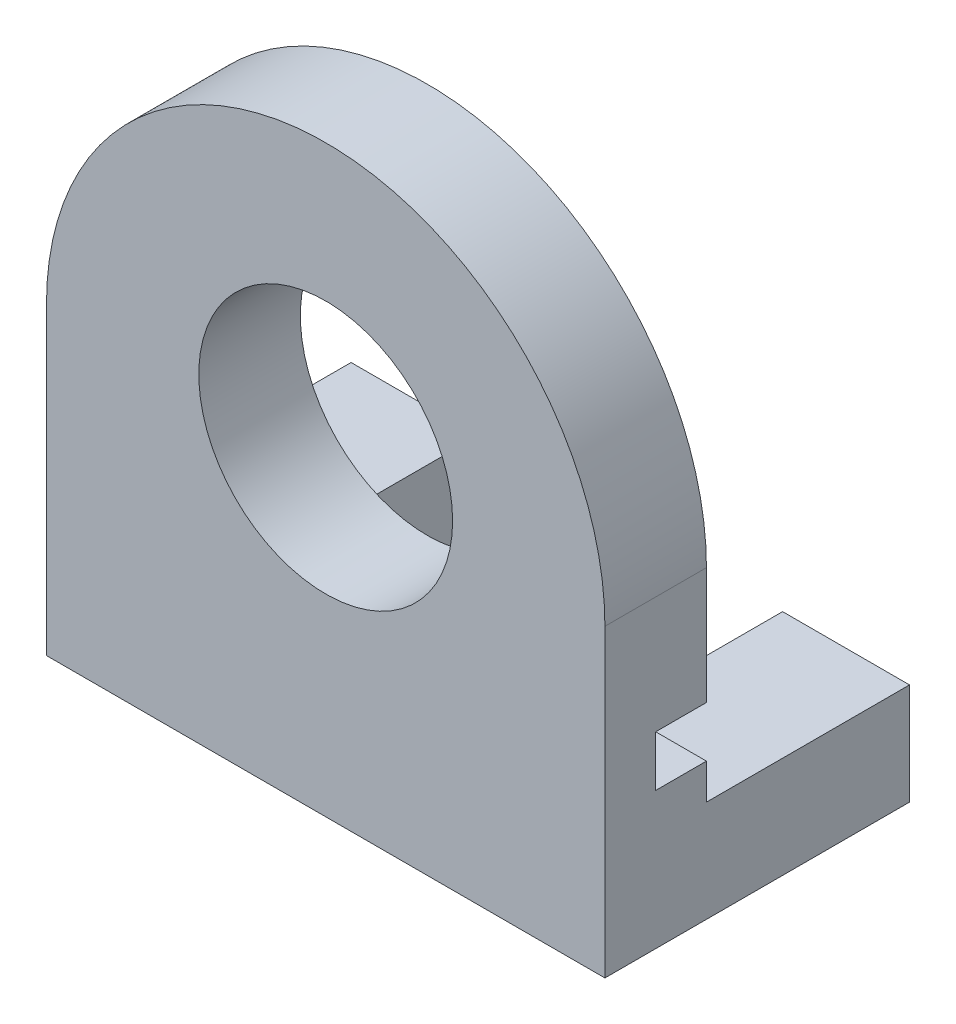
from build123d import *

# Parameters (mm, degrees)
BASE_EXTRUSION_DEPTH    = 2
ESQUISSE2_W             = 2.5
ESQUISSE2_H             = 2
BOSS_EXTRU_1_DEPTH      = 4
ESQUISSE3_W             = 2.5
ESQUISSE3_H             = 2
BOSS_EXTRU_2_DEPTH      = 4
ESQUISSE4_R             = 2.5
ENL_V_MAT_EXTRU_1_DEPTH = 2
ESQUISSE5_W             = 1
ESQUISSE5_H             = 1
ENL_V_MAT_EXTRU_2_DEPTH = 11.5


with BuildPart() as part:
    # Esquisse1 → Base-Extrusion (new body)
    with BuildSketch(Plane.XY):
        with BuildLine():
            Line((0, 0), (11, 0))
            Line((11, 0), (11, 6))
            ThreePointArc((11, 6), (5.5, 11.5), (0, 6))
            Line((0, 6), (0, 0))
        make_face()
    extrude(amount=-BASE_EXTRUSION_DEPTH)

    # Esquisse2 → Boss.-Extru.1 (add)
    with BuildSketch(Plane(origin=(0, 0, -2), x_dir=(-1, 0, 0), z_dir=(0, 0, -1))):
        with Locations((-1.25, 1)):
            Rectangle(ESQUISSE2_W, ESQUISSE2_H)
    extrude(amount=BOSS_EXTRU_1_DEPTH)

    # Esquisse3 → Boss.-Extru.2 (add)
    with BuildSketch(Plane(origin=(0, 0, -2), x_dir=(-1, 0, 0), z_dir=(0, 0, -1))):
        with Locations((-9.75, 1)):
            Rectangle(ESQUISSE3_W, ESQUISSE3_H)
    extrude(amount=BOSS_EXTRU_2_DEPTH)

    # Esquisse4 → Enl_v. mat.-Extru.1 (cut)
    with BuildSketch(Plane.XY):
        with Locations((5.5, 6.3)):
            Circle(ESQUISSE4_R)
    extrude(amount=-ENL_V_MAT_EXTRU_1_DEPTH, mode=Mode.SUBTRACT)

    # Esquisse5 → Enl_v. mat.-Extru.2 (cut)
    with BuildSketch(Plane.ZY):
        with Locations((-1.5, 3.2)):
            Rectangle(ESQUISSE5_W, ESQUISSE5_H)
    extrude(amount=-ENL_V_MAT_EXTRU_2_DEPTH, mode=Mode.SUBTRACT)


solid = part.part
